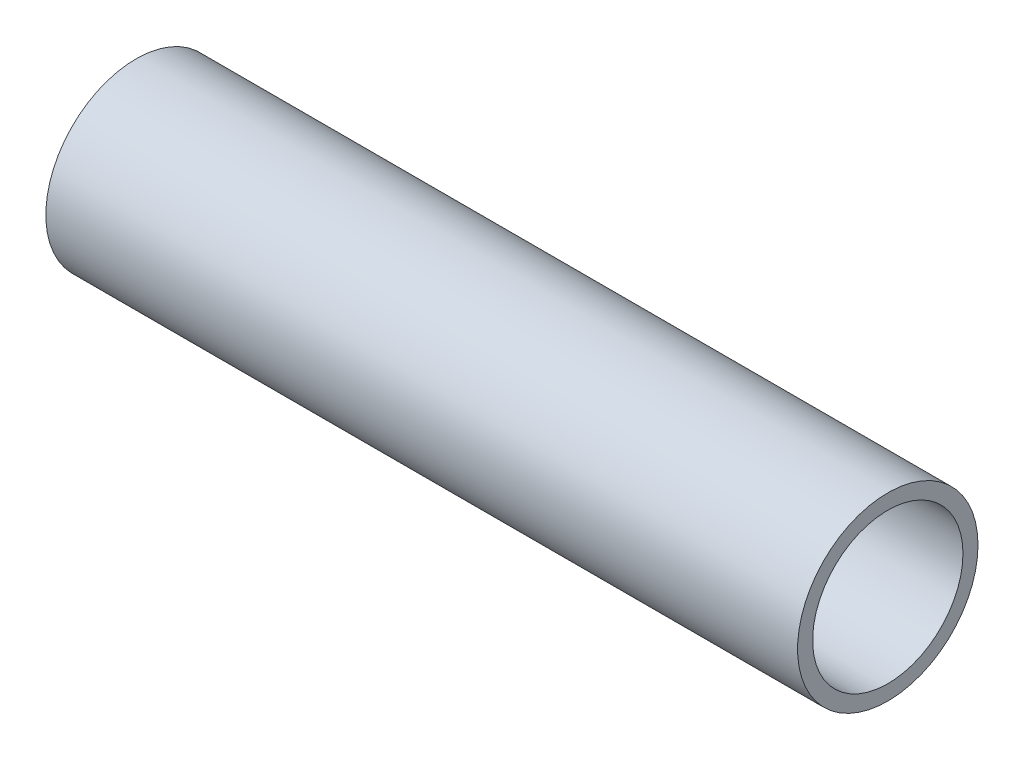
from build123d import *

# Parameters (mm, degrees)
SKETCH1_R      = 6
SKETCH1_R_2    = 5
EXTRUDE1_DEPTH = 25


with BuildPart() as part:
    # Sketch1 → Extrude1 (new, symmetric)
    with BuildSketch(Plane(origin=(0, 0, 0), x_dir=(0, 0, -1), z_dir=(1, 0, 0))):
        Circle(SKETCH1_R)
        Circle(SKETCH1_R_2, mode=Mode.SUBTRACT)
    extrude(amount=EXTRUDE1_DEPTH, both=True)


solid = part.part
